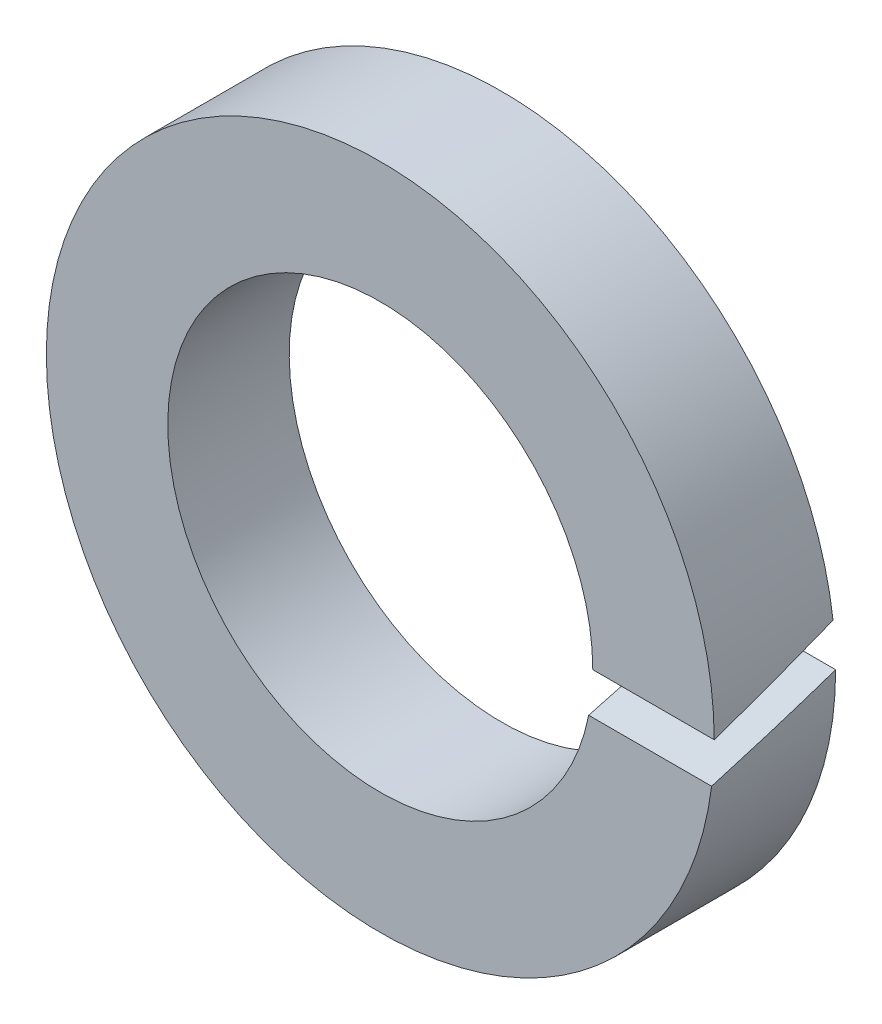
ISO-10303-21;
HEADER;
FILE_DESCRIPTION(('STEP AP214'),'2;1');
FILE_NAME('part.step','',(''),(''),'','','');
FILE_SCHEMA(('AUTOMOTIVE_DESIGN { 1 0 10303 214 1 1 1 1 }'));
ENDSEC;
DATA;
#1=APPLICATION_CONTEXT('core data for automotive mechanical design processes');
#2=APPLICATION_PROTOCOL_DEFINITION('international standard','automotive_design',2000,#1);
#3=PRODUCT_CONTEXT('',#1,'mechanical');
#4=PRODUCT('Part','Part','',(#3));
#5=PRODUCT_RELATED_PRODUCT_CATEGORY('part','',(#4));
#6=PRODUCT_DEFINITION_FORMATION('','',#4);
#7=PRODUCT_DEFINITION_CONTEXT('part definition',#1,'design');
#8=PRODUCT_DEFINITION('design','',#6,#7);
#9=PRODUCT_DEFINITION_SHAPE('','',#8);
#10=(LENGTH_UNIT() NAMED_UNIT(*) SI_UNIT(.MILLI.,.METRE.));
#11=(NAMED_UNIT(*) PLANE_ANGLE_UNIT() SI_UNIT($,.RADIAN.));
#12=(NAMED_UNIT(*) SI_UNIT($,.STERADIAN.) SOLID_ANGLE_UNIT());
#13=UNCERTAINTY_MEASURE_WITH_UNIT(LENGTH_MEASURE(1.E-05),#10,'distance_accuracy_value','');
#14=(GEOMETRIC_REPRESENTATION_CONTEXT(3) GLOBAL_UNCERTAINTY_ASSIGNED_CONTEXT((#13)) GLOBAL_UNIT_ASSIGNED_CONTEXT((#10,
#11,#12)) REPRESENTATION_CONTEXT('',''));
#15=CARTESIAN_POINT('',(0.,0.,0.));
#16=DIRECTION('',(0.,0.,1.));
#17=DIRECTION('',(1.,0.,0.));
#18=AXIS2_PLACEMENT_3D('',#15,#16,#17);
#19=CARTESIAN_POINT('',(0.,0.,3.));
#20=DIRECTION('',(0.,0.,-1.));
#21=DIRECTION('',(-1.,0.,0.));
#22=AXIS2_PLACEMENT_3D('',#19,#20,#21);
#23=CYLINDRICAL_SURFACE('',#22,8.25);
#24=CARTESIAN_POINT('',(0.,0.,3.));
#25=DIRECTION('',(0.,-0.946218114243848,-0.323529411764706));
#26=DIRECTION('',(0.,0.323529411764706,-0.946218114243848));
#27=AXIS2_PLACEMENT_3D('',#24,#25,#26);
#28=ELLIPSE('',#27,25.5,8.25);
#29=CARTESIAN_POINT('',(8.18598351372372,1.02575528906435,0.));
#30=VERTEX_POINT('',#29);
#31=CARTESIAN_POINT('',(8.25000000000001,0.,3.));
#32=VERTEX_POINT('',#31);
#33=EDGE_CURVE('E65',#30,#32,#28,.T.);
#34=ORIENTED_EDGE('',*,*,#33,.F.);
#35=CARTESIAN_POINT('',(0.,0.,0.));
#36=DIRECTION('',(0.,0.,1.));
#37=DIRECTION('',(1.,0.,0.));
#38=AXIS2_PLACEMENT_3D('',#35,#36,#37);
#39=CIRCLE('',#38,8.25);
#40=CARTESIAN_POINT('',(8.25000000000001,0.,0.));
#41=VERTEX_POINT('',#40);
#42=EDGE_CURVE('E86',#30,#41,#39,.T.);
#43=ORIENTED_EDGE('',*,*,#42,.T.);
#44=CARTESIAN_POINT('',(0.,0.,0.));
#45=DIRECTION('',(0.,0.946218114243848,0.323529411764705));
#46=DIRECTION('',(0.,0.323529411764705,-0.946218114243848));
#47=AXIS2_PLACEMENT_3D('',#44,#45,#46);
#48=ELLIPSE('',#47,25.5,8.25);
#49=CARTESIAN_POINT('',(8.18598351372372,-1.02575528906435,3.));
#50=VERTEX_POINT('',#49);
#51=EDGE_CURVE('E74',#50,#41,#48,.T.);
#52=ORIENTED_EDGE('',*,*,#51,.F.);
#53=CARTESIAN_POINT('',(0.,0.,3.));
#54=DIRECTION('',(0.,0.,1.));
#55=DIRECTION('',(1.,0.,0.));
#56=AXIS2_PLACEMENT_3D('',#53,#54,#55);
#57=CIRCLE('',#56,8.25);
#58=EDGE_CURVE('E81',#32,#50,#57,.T.);
#59=ORIENTED_EDGE('',*,*,#58,.F.);
#60=EDGE_LOOP('',(#34,#43,#52,#59));
#61=FACE_BOUND('',#60,.T.);
#62=ADVANCED_FACE('F28',(#61),#23,.T.);
#63=CARTESIAN_POINT('',(0.,0.,3.));
#64=DIRECTION('',(0.,0.,1.));
#65=DIRECTION('',(1.,0.,0.));
#66=AXIS2_PLACEMENT_3D('',#63,#64,#65);
#67=PLANE('',#66);
#68=CARTESIAN_POINT('',(0.,0.,3.));
#69=DIRECTION('',(0.,0.,1.));
#70=DIRECTION('',(1.,0.,0.));
#71=AXIS2_PLACEMENT_3D('',#68,#69,#70);
#72=CIRCLE('',#71,5.25);
#73=CARTESIAN_POINT('',(5.25,0.,3.));
#74=VERTEX_POINT('',#73);
#75=CARTESIAN_POINT('',(5.14881793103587,-1.02575528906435,3.));
#76=VERTEX_POINT('',#75);
#77=EDGE_CURVE('E73',#74,#76,#72,.T.);
#78=ORIENTED_EDGE('',*,*,#77,.F.);
#79=DIRECTION('',(-1.,0.,0.));
#80=VECTOR('',#79,1.);
#81=CARTESIAN_POINT('',(8.25000000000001,0.,3.));
#82=LINE('',#81,#80);
#83=EDGE_CURVE('E41',#32,#74,#82,.T.);
#84=ORIENTED_EDGE('',*,*,#83,.F.);
#85=ORIENTED_EDGE('',*,*,#58,.T.);
#86=DIRECTION('',(-1.,0.,0.));
#87=VECTOR('',#86,1.);
#88=CARTESIAN_POINT('',(8.25,-1.02575528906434,3.));
#89=LINE('',#88,#87);
#90=EDGE_CURVE('E83',#50,#76,#89,.T.);
#91=ORIENTED_EDGE('',*,*,#90,.T.);
#92=EDGE_LOOP('',(#78,#84,#85,#91));
#93=FACE_BOUND('',#92,.T.);
#94=ADVANCED_FACE('F79',(#93),#67,.T.);
#95=CARTESIAN_POINT('',(0.,0.,0.));
#96=DIRECTION('',(0.,0.,1.));
#97=DIRECTION('',(1.,0.,0.));
#98=AXIS2_PLACEMENT_3D('',#95,#96,#97);
#99=PLANE('',#98);
#100=DIRECTION('',(-1.,0.,0.));
#101=VECTOR('',#100,1.);
#102=CARTESIAN_POINT('',(8.25,1.02575528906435,0.));
#103=LINE('',#102,#101);
#104=CARTESIAN_POINT('',(5.14881793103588,1.02575528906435,0.));
#105=VERTEX_POINT('',#104);
#106=EDGE_CURVE('E68',#30,#105,#103,.T.);
#107=ORIENTED_EDGE('',*,*,#106,.T.);
#108=CARTESIAN_POINT('',(0.,0.,0.));
#109=DIRECTION('',(0.,0.,1.));
#110=DIRECTION('',(1.,0.,0.));
#111=AXIS2_PLACEMENT_3D('',#108,#109,#110);
#112=CIRCLE('',#111,5.25);
#113=CARTESIAN_POINT('',(5.25,0.,0.));
#114=VERTEX_POINT('',#113);
#115=EDGE_CURVE('E88',#105,#114,#112,.T.);
#116=ORIENTED_EDGE('',*,*,#115,.T.);
#117=DIRECTION('',(-1.,0.,0.));
#118=VECTOR('',#117,1.);
#119=CARTESIAN_POINT('',(8.25000000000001,0.,0.));
#120=LINE('',#119,#118);
#121=EDGE_CURVE('E49',#41,#114,#120,.T.);
#122=ORIENTED_EDGE('',*,*,#121,.F.);
#123=ORIENTED_EDGE('',*,*,#42,.F.);
#124=EDGE_LOOP('',(#107,#116,#122,#123));
#125=FACE_BOUND('',#124,.T.);
#126=ADVANCED_FACE('F101',(#125),#99,.F.);
#127=CARTESIAN_POINT('',(0.,0.,0.));
#128=DIRECTION('',(0.,0.,1.));
#129=DIRECTION('',(1.,0.,0.));
#130=AXIS2_PLACEMENT_3D('',#127,#128,#129);
#131=CYLINDRICAL_SURFACE('',#130,5.25);
#132=CARTESIAN_POINT('',(0.,0.,3.));
#133=DIRECTION('',(0.,-0.946218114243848,-0.323529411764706));
#134=DIRECTION('',(0.,-0.323529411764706,0.946218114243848));
#135=AXIS2_PLACEMENT_3D('',#132,#133,#134);
#136=ELLIPSE('',#135,16.2272727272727,5.25);
#137=EDGE_CURVE('E11',#74,#105,#136,.F.);
#138=ORIENTED_EDGE('',*,*,#137,.F.);
#139=ORIENTED_EDGE('',*,*,#77,.T.);
#140=CARTESIAN_POINT('',(0.,0.,0.));
#141=DIRECTION('',(0.,0.946218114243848,0.323529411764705));
#142=DIRECTION('',(0.,-0.323529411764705,0.946218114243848));
#143=AXIS2_PLACEMENT_3D('',#140,#141,#142);
#144=ELLIPSE('',#143,16.2272727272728,5.25);
#145=EDGE_CURVE('E35',#114,#76,#144,.F.);
#146=ORIENTED_EDGE('',*,*,#145,.F.);
#147=ORIENTED_EDGE('',*,*,#115,.F.);
#148=EDGE_LOOP('',(#138,#139,#146,#147));
#149=FACE_BOUND('',#148,.T.);
#150=ADVANCED_FACE('F98',(#149),#131,.F.);
#151=CARTESIAN_POINT('',(8.25,-1.02575528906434,3.));
#152=DIRECTION('',(0.,0.946218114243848,0.323529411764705));
#153=DIRECTION('',(0.,-0.323529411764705,0.946218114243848));
#154=AXIS2_PLACEMENT_3D('',#151,#152,#153);
#155=PLANE('',#154);
#156=ORIENTED_EDGE('',*,*,#51,.T.);
#157=ORIENTED_EDGE('',*,*,#121,.T.);
#158=ORIENTED_EDGE('',*,*,#145,.T.);
#159=ORIENTED_EDGE('',*,*,#90,.F.);
#160=EDGE_LOOP('',(#156,#157,#158,#159));
#161=FACE_BOUND('',#160,.T.);
#162=ADVANCED_FACE('F107',(#161),#155,.T.);
#163=CARTESIAN_POINT('',(8.25,1.02575528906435,0.));
#164=DIRECTION('',(0.,-0.946218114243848,-0.323529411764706));
#165=DIRECTION('',(0.,0.323529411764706,-0.946218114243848));
#166=AXIS2_PLACEMENT_3D('',#163,#164,#165);
#167=PLANE('',#166);
#168=ORIENTED_EDGE('',*,*,#33,.T.);
#169=ORIENTED_EDGE('',*,*,#83,.T.);
#170=ORIENTED_EDGE('',*,*,#137,.T.);
#171=ORIENTED_EDGE('',*,*,#106,.F.);
#172=EDGE_LOOP('',(#168,#169,#170,#171));
#173=FACE_BOUND('',#172,.T.);
#174=ADVANCED_FACE('F66',(#173),#167,.T.);
#175=CLOSED_SHELL('',(#62,#94,#126,#150,#162,#174));
#176=MANIFOLD_SOLID_BREP('B2',#175);
#177=ADVANCED_BREP_SHAPE_REPRESENTATION('',(#18,#176),#14);
#178=SHAPE_DEFINITION_REPRESENTATION(#9,#177);
ENDSEC;
END-ISO-10303-21;
